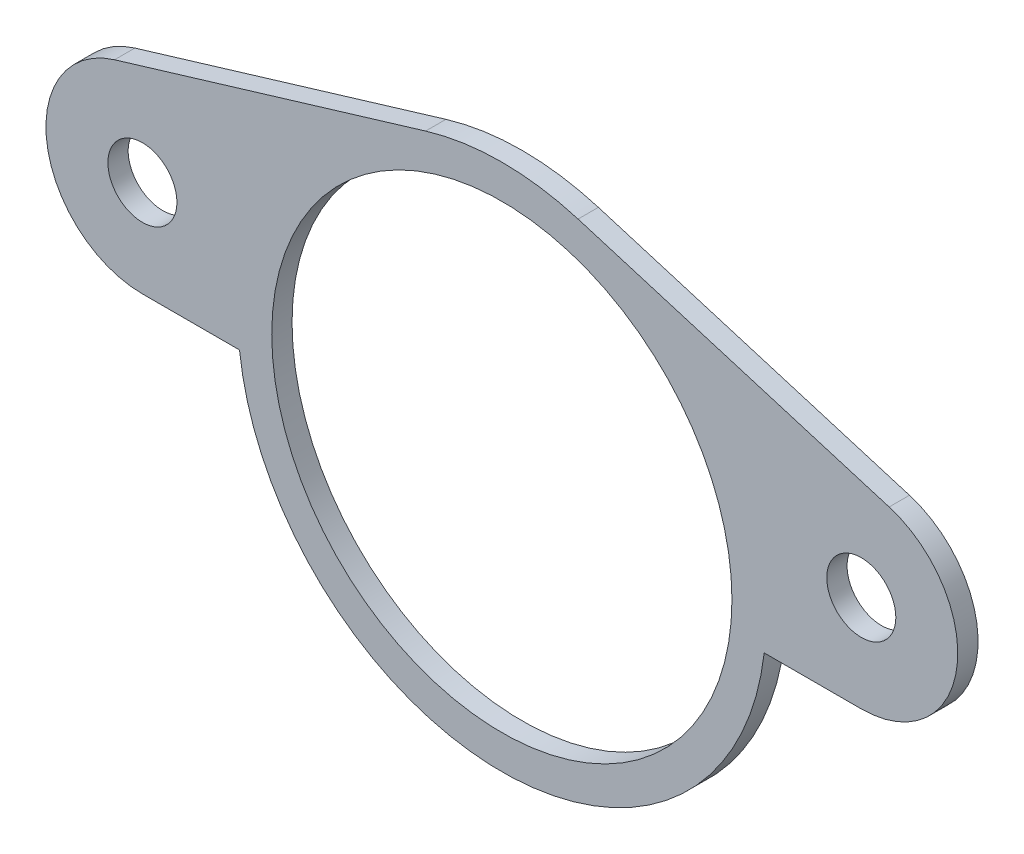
ISO-10303-21;
HEADER;
FILE_DESCRIPTION(('STEP AP214'),'2;1');
FILE_NAME('part.step','',(''),(''),'','','');
FILE_SCHEMA(('AUTOMOTIVE_DESIGN { 1 0 10303 214 1 1 1 1 }'));
ENDSEC;
DATA;
#1=APPLICATION_CONTEXT('core data for automotive mechanical design processes');
#2=APPLICATION_PROTOCOL_DEFINITION('international standard','automotive_design',2000,#1);
#3=PRODUCT_CONTEXT('',#1,'mechanical');
#4=PRODUCT('Part','Part','',(#3));
#5=PRODUCT_RELATED_PRODUCT_CATEGORY('part','',(#4));
#6=PRODUCT_DEFINITION_FORMATION('','',#4);
#7=PRODUCT_DEFINITION_CONTEXT('part definition',#1,'design');
#8=PRODUCT_DEFINITION('design','',#6,#7);
#9=PRODUCT_DEFINITION_SHAPE('','',#8);
#10=(LENGTH_UNIT() NAMED_UNIT(*) SI_UNIT(.MILLI.,.METRE.));
#11=(NAMED_UNIT(*) PLANE_ANGLE_UNIT() SI_UNIT($,.RADIAN.));
#12=(NAMED_UNIT(*) SI_UNIT($,.STERADIAN.) SOLID_ANGLE_UNIT());
#13=UNCERTAINTY_MEASURE_WITH_UNIT(LENGTH_MEASURE(1.E-05),#10,'distance_accuracy_value','');
#14=(GEOMETRIC_REPRESENTATION_CONTEXT(3) GLOBAL_UNCERTAINTY_ASSIGNED_CONTEXT((#13)) GLOBAL_UNIT_ASSIGNED_CONTEXT((#10,
#11,#12)) REPRESENTATION_CONTEXT('',''));
#15=CARTESIAN_POINT('',(0.,0.,0.));
#16=DIRECTION('',(0.,0.,1.));
#17=DIRECTION('',(1.,0.,0.));
#18=AXIS2_PLACEMENT_3D('',#15,#16,#17);
#19=CARTESIAN_POINT('',(-17.6986327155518,3.28,1.));
#20=DIRECTION('',(0.,0.,1.));
#21=DIRECTION('',(1.,0.,0.));
#22=AXIS2_PLACEMENT_3D('',#19,#20,#21);
#23=PLANE('',#22);
#24=CARTESIAN_POINT('',(17.6986327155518,3.28,1.));
#25=DIRECTION('',(0.,0.,1.));
#26=DIRECTION('',(1.,0.,0.));
#27=AXIS2_PLACEMENT_3D('',#24,#25,#26);
#28=CIRCLE('',#27,1.7);
#29=CARTESIAN_POINT('',(19.3986327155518,3.28,1.));
#30=VERTEX_POINT('',#29);
#31=EDGE_CURVE('E190',#30,#30,#28,.T.);
#32=ORIENTED_EDGE('',*,*,#31,.F.);
#33=EDGE_LOOP('',(#32));
#34=FACE_BOUND('',#33,.T.);
#35=CARTESIAN_POINT('',(-17.6986327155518,3.28,1.));
#36=DIRECTION('',(0.,0.,1.));
#37=DIRECTION('',(1.,0.,0.));
#38=AXIS2_PLACEMENT_3D('',#35,#36,#37);
#39=CIRCLE('',#38,4.75);
#40=CARTESIAN_POINT('',(-19.0699771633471,7.82773728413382,1.));
#41=VERTEX_POINT('',#40);
#42=CARTESIAN_POINT('',(-17.6986327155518,-1.47,1.));
#43=VERTEX_POINT('',#42);
#44=EDGE_CURVE('E153',#41,#43,#39,.T.);
#45=ORIENTED_EDGE('',*,*,#44,.T.);
#46=DIRECTION('',(1.,0.,0.));
#47=VECTOR('',#46,1.);
#48=CARTESIAN_POINT('',(-12.9166210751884,-1.47,1.));
#49=LINE('',#48,#47);
#50=CARTESIAN_POINT('',(-12.9166210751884,-1.47,1.));
#51=VERTEX_POINT('',#50);
#52=EDGE_CURVE('E101',#43,#51,#49,.T.);
#53=ORIENTED_EDGE('',*,*,#52,.T.);
#54=CARTESIAN_POINT('',(0.,0.,1.));
#55=DIRECTION('',(0.,0.,1.));
#56=DIRECTION('',(-1.,0.,0.));
#57=AXIS2_PLACEMENT_3D('',#54,#55,#56);
#58=CIRCLE('',#57,13.);
#59=CARTESIAN_POINT('',(12.9166210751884,-1.47,1.));
#60=VERTEX_POINT('',#59);
#61=EDGE_CURVE('E168',#51,#60,#58,.T.);
#62=ORIENTED_EDGE('',*,*,#61,.T.);
#63=DIRECTION('',(1.,0.,0.));
#64=VECTOR('',#63,1.);
#65=CARTESIAN_POINT('',(12.9166210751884,-1.47,1.));
#66=LINE('',#65,#64);
#67=CARTESIAN_POINT('',(17.6986327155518,-1.47,1.));
#68=VERTEX_POINT('',#67);
#69=EDGE_CURVE('E181',#60,#68,#66,.T.);
#70=ORIENTED_EDGE('',*,*,#69,.T.);
#71=CARTESIAN_POINT('',(17.6986327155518,3.28,1.));
#72=DIRECTION('',(0.,0.,1.));
#73=DIRECTION('',(-1.,0.,0.));
#74=AXIS2_PLACEMENT_3D('',#71,#72,#73);
#75=CIRCLE('',#74,4.75);
#76=CARTESIAN_POINT('',(19.0699771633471,7.82773728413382,1.));
#77=VERTEX_POINT('',#76);
#78=EDGE_CURVE('E120',#68,#77,#75,.T.);
#79=ORIENTED_EDGE('',*,*,#78,.T.);
#80=DIRECTION('',(-0.95741837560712,0.288704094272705,0.));
#81=VECTOR('',#80,1.);
#82=CARTESIAN_POINT('',(3.75315322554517,12.4464388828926,1.));
#83=LINE('',#82,#81);
#84=CARTESIAN_POINT('',(3.75315322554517,12.4464388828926,1.));
#85=VERTEX_POINT('',#84);
#86=EDGE_CURVE('E114',#77,#85,#83,.T.);
#87=ORIENTED_EDGE('',*,*,#86,.T.);
#88=CARTESIAN_POINT('',(0.,0.,1.));
#89=DIRECTION('',(0.,0.,1.));
#90=DIRECTION('',(-1.,0.,0.));
#91=AXIS2_PLACEMENT_3D('',#88,#89,#90);
#92=CIRCLE('',#91,13.);
#93=CARTESIAN_POINT('',(-3.75315322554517,12.4464388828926,1.));
#94=VERTEX_POINT('',#93);
#95=EDGE_CURVE('E118',#85,#94,#92,.T.);
#96=ORIENTED_EDGE('',*,*,#95,.T.);
#97=DIRECTION('',(-0.95741837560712,-0.288704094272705,0.));
#98=VECTOR('',#97,1.);
#99=CARTESIAN_POINT('',(-19.0699771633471,7.82773728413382,1.));
#100=LINE('',#99,#98);
#101=EDGE_CURVE('E58',#94,#41,#100,.T.);
#102=ORIENTED_EDGE('',*,*,#101,.T.);
#103=EDGE_LOOP('',(#45,#53,#62,#70,#79,#87,#96,#102));
#104=FACE_BOUND('',#103,.T.);
#105=CARTESIAN_POINT('',(-17.6986327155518,3.28,1.));
#106=DIRECTION('',(0.,0.,1.));
#107=DIRECTION('',(1.,0.,0.));
#108=AXIS2_PLACEMENT_3D('',#105,#106,#107);
#109=CIRCLE('',#108,1.7);
#110=CARTESIAN_POINT('',(-15.9986327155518,3.28,1.));
#111=VERTEX_POINT('',#110);
#112=EDGE_CURVE('E142',#111,#111,#109,.T.);
#113=ORIENTED_EDGE('',*,*,#112,.F.);
#114=EDGE_LOOP('',(#113));
#115=FACE_BOUND('',#114,.T.);
#116=CARTESIAN_POINT('',(0.,0.,1.));
#117=DIRECTION('',(0.,0.,1.));
#118=DIRECTION('',(1.,0.,0.));
#119=AXIS2_PLACEMENT_3D('',#116,#117,#118);
#120=CIRCLE('',#119,11.33);
#121=CARTESIAN_POINT('',(11.33,0.,1.));
#122=VERTEX_POINT('',#121);
#123=EDGE_CURVE('E196',#122,#122,#120,.T.);
#124=ORIENTED_EDGE('',*,*,#123,.F.);
#125=EDGE_LOOP('',(#124));
#126=FACE_BOUND('',#125,.T.);
#127=ADVANCED_FACE('F41',(#34,#104,#115,#126),#23,.T.);
#128=CARTESIAN_POINT('',(-17.6986327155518,3.28,0.));
#129=DIRECTION('',(0.,0.,1.));
#130=DIRECTION('',(1.,0.,0.));
#131=AXIS2_PLACEMENT_3D('',#128,#129,#130);
#132=PLANE('',#131);
#133=CARTESIAN_POINT('',(-17.6986327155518,3.28,0.));
#134=DIRECTION('',(0.,0.,1.));
#135=DIRECTION('',(1.,0.,0.));
#136=AXIS2_PLACEMENT_3D('',#133,#134,#135);
#137=CIRCLE('',#136,4.75);
#138=CARTESIAN_POINT('',(-19.0699771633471,7.82773728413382,0.));
#139=VERTEX_POINT('',#138);
#140=CARTESIAN_POINT('',(-17.6986327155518,-1.47,0.));
#141=VERTEX_POINT('',#140);
#142=EDGE_CURVE('E138',#139,#141,#137,.T.);
#143=ORIENTED_EDGE('',*,*,#142,.F.);
#144=DIRECTION('',(-0.95741837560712,-0.288704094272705,0.));
#145=VECTOR('',#144,1.);
#146=CARTESIAN_POINT('',(-19.0699771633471,7.82773728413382,0.));
#147=LINE('',#146,#145);
#148=CARTESIAN_POINT('',(-3.75315322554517,12.4464388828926,0.));
#149=VERTEX_POINT('',#148);
#150=EDGE_CURVE('E93',#149,#139,#147,.T.);
#151=ORIENTED_EDGE('',*,*,#150,.F.);
#152=CARTESIAN_POINT('',(0.,0.,0.));
#153=DIRECTION('',(0.,0.,1.));
#154=DIRECTION('',(-1.,0.,0.));
#155=AXIS2_PLACEMENT_3D('',#152,#153,#154);
#156=CIRCLE('',#155,13.);
#157=CARTESIAN_POINT('',(3.75315322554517,12.4464388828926,0.));
#158=VERTEX_POINT('',#157);
#159=EDGE_CURVE('E87',#158,#149,#156,.T.);
#160=ORIENTED_EDGE('',*,*,#159,.F.);
#161=DIRECTION('',(-0.95741837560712,0.288704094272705,0.));
#162=VECTOR('',#161,1.);
#163=CARTESIAN_POINT('',(3.75315322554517,12.4464388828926,0.));
#164=LINE('',#163,#162);
#165=CARTESIAN_POINT('',(19.0699771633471,7.82773728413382,0.));
#166=VERTEX_POINT('',#165);
#167=EDGE_CURVE('E128',#166,#158,#164,.T.);
#168=ORIENTED_EDGE('',*,*,#167,.F.);
#169=CARTESIAN_POINT('',(17.6986327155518,3.28,0.));
#170=DIRECTION('',(0.,0.,1.));
#171=DIRECTION('',(-1.,0.,0.));
#172=AXIS2_PLACEMENT_3D('',#169,#170,#171);
#173=CIRCLE('',#172,4.75);
#174=CARTESIAN_POINT('',(17.6986327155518,-1.47,0.));
#175=VERTEX_POINT('',#174);
#176=EDGE_CURVE('E148',#175,#166,#173,.T.);
#177=ORIENTED_EDGE('',*,*,#176,.F.);
#178=DIRECTION('',(1.,0.,0.));
#179=VECTOR('',#178,1.);
#180=CARTESIAN_POINT('',(12.9166210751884,-1.47,0.));
#181=LINE('',#180,#179);
#182=CARTESIAN_POINT('',(12.9166210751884,-1.47,0.));
#183=VERTEX_POINT('',#182);
#184=EDGE_CURVE('E146',#183,#175,#181,.T.);
#185=ORIENTED_EDGE('',*,*,#184,.F.);
#186=CARTESIAN_POINT('',(0.,0.,0.));
#187=DIRECTION('',(0.,0.,1.));
#188=DIRECTION('',(-1.,0.,0.));
#189=AXIS2_PLACEMENT_3D('',#186,#187,#188);
#190=CIRCLE('',#189,13.);
#191=CARTESIAN_POINT('',(-12.9166210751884,-1.47,0.));
#192=VERTEX_POINT('',#191);
#193=EDGE_CURVE('E144',#192,#183,#190,.T.);
#194=ORIENTED_EDGE('',*,*,#193,.F.);
#195=DIRECTION('',(1.,0.,0.));
#196=VECTOR('',#195,1.);
#197=CARTESIAN_POINT('',(-12.9166210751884,-1.47,0.));
#198=LINE('',#197,#196);
#199=EDGE_CURVE('E141',#141,#192,#198,.T.);
#200=ORIENTED_EDGE('',*,*,#199,.F.);
#201=EDGE_LOOP('',(#143,#151,#160,#168,#177,#185,#194,#200));
#202=FACE_BOUND('',#201,.T.);
#203=CARTESIAN_POINT('',(-17.6986327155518,3.28,0.));
#204=DIRECTION('',(0.,0.,1.));
#205=DIRECTION('',(1.,0.,0.));
#206=AXIS2_PLACEMENT_3D('',#203,#204,#205);
#207=CIRCLE('',#206,1.7);
#208=CARTESIAN_POINT('',(-15.9986327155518,3.28,0.));
#209=VERTEX_POINT('',#208);
#210=EDGE_CURVE('E187',#209,#209,#207,.T.);
#211=ORIENTED_EDGE('',*,*,#210,.T.);
#212=EDGE_LOOP('',(#211));
#213=FACE_BOUND('',#212,.T.);
#214=CARTESIAN_POINT('',(17.6986327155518,3.28,0.));
#215=DIRECTION('',(0.,0.,1.));
#216=DIRECTION('',(1.,0.,0.));
#217=AXIS2_PLACEMENT_3D('',#214,#215,#216);
#218=CIRCLE('',#217,1.7);
#219=CARTESIAN_POINT('',(19.3986327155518,3.28,0.));
#220=VERTEX_POINT('',#219);
#221=EDGE_CURVE('E193',#220,#220,#218,.T.);
#222=ORIENTED_EDGE('',*,*,#221,.T.);
#223=EDGE_LOOP('',(#222));
#224=FACE_BOUND('',#223,.T.);
#225=CARTESIAN_POINT('',(0.,0.,0.));
#226=DIRECTION('',(0.,0.,1.));
#227=DIRECTION('',(1.,0.,0.));
#228=AXIS2_PLACEMENT_3D('',#225,#226,#227);
#229=CIRCLE('',#228,11.33);
#230=CARTESIAN_POINT('',(11.33,0.,0.));
#231=VERTEX_POINT('',#230);
#232=EDGE_CURVE('E199',#231,#231,#229,.T.);
#233=ORIENTED_EDGE('',*,*,#232,.T.);
#234=EDGE_LOOP('',(#233));
#235=FACE_BOUND('',#234,.T.);
#236=ADVANCED_FACE('F172',(#202,#213,#224,#235),#132,.F.);
#237=CARTESIAN_POINT('',(-17.6986327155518,3.28,1.));
#238=DIRECTION('',(0.,0.,-1.));
#239=DIRECTION('',(-1.,0.,0.));
#240=AXIS2_PLACEMENT_3D('',#237,#238,#239);
#241=CYLINDRICAL_SURFACE('',#240,4.75);
#242=ORIENTED_EDGE('',*,*,#142,.T.);
#243=DIRECTION('',(0.,0.,-1.));
#244=VECTOR('',#243,1.);
#245=CARTESIAN_POINT('',(-17.6986327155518,-1.47,1.));
#246=LINE('',#245,#244);
#247=EDGE_CURVE('E11',#43,#141,#246,.T.);
#248=ORIENTED_EDGE('',*,*,#247,.F.);
#249=ORIENTED_EDGE('',*,*,#44,.F.);
#250=DIRECTION('',(0.,0.,-1.));
#251=VECTOR('',#250,1.);
#252=CARTESIAN_POINT('',(-19.0699771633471,7.82773728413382,1.));
#253=LINE('',#252,#251);
#254=EDGE_CURVE('E134',#41,#139,#253,.T.);
#255=ORIENTED_EDGE('',*,*,#254,.T.);
#256=EDGE_LOOP('',(#242,#248,#249,#255));
#257=FACE_BOUND('',#256,.T.);
#258=ADVANCED_FACE('F43',(#257),#241,.T.);
#259=CARTESIAN_POINT('',(-12.9166210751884,-1.47,1.));
#260=DIRECTION('',(0.,1.,0.));
#261=DIRECTION('',(-1.,0.,0.));
#262=AXIS2_PLACEMENT_3D('',#259,#260,#261);
#263=PLANE('',#262);
#264=ORIENTED_EDGE('',*,*,#199,.T.);
#265=DIRECTION('',(0.,0.,-1.));
#266=VECTOR('',#265,1.);
#267=CARTESIAN_POINT('',(-12.9166210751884,-1.47,1.));
#268=LINE('',#267,#266);
#269=EDGE_CURVE('E50',#51,#192,#268,.T.);
#270=ORIENTED_EDGE('',*,*,#269,.F.);
#271=ORIENTED_EDGE('',*,*,#52,.F.);
#272=ORIENTED_EDGE('',*,*,#247,.T.);
#273=EDGE_LOOP('',(#264,#270,#271,#272));
#274=FACE_BOUND('',#273,.T.);
#275=ADVANCED_FACE('F232',(#274),#263,.F.);
#276=CARTESIAN_POINT('',(0.,0.,1.));
#277=DIRECTION('',(0.,0.,-1.));
#278=DIRECTION('',(-1.,0.,0.));
#279=AXIS2_PLACEMENT_3D('',#276,#277,#278);
#280=CYLINDRICAL_SURFACE('',#279,13.);
#281=ORIENTED_EDGE('',*,*,#193,.T.);
#282=DIRECTION('',(0.,0.,-1.));
#283=VECTOR('',#282,1.);
#284=CARTESIAN_POINT('',(12.9166210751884,-1.47,1.));
#285=LINE('',#284,#283);
#286=EDGE_CURVE('E160',#60,#183,#285,.T.);
#287=ORIENTED_EDGE('',*,*,#286,.F.);
#288=ORIENTED_EDGE('',*,*,#61,.F.);
#289=ORIENTED_EDGE('',*,*,#269,.T.);
#290=EDGE_LOOP('',(#281,#287,#288,#289));
#291=FACE_BOUND('',#290,.T.);
#292=ADVANCED_FACE('F166',(#291),#280,.T.);
#293=CARTESIAN_POINT('',(12.9166210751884,-1.47,1.));
#294=DIRECTION('',(0.,1.,0.));
#295=DIRECTION('',(-1.,0.,0.));
#296=AXIS2_PLACEMENT_3D('',#293,#294,#295);
#297=PLANE('',#296);
#298=ORIENTED_EDGE('',*,*,#184,.T.);
#299=DIRECTION('',(0.,0.,-1.));
#300=VECTOR('',#299,1.);
#301=CARTESIAN_POINT('',(17.6986327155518,-1.47,1.));
#302=LINE('',#301,#300);
#303=EDGE_CURVE('E157',#68,#175,#302,.T.);
#304=ORIENTED_EDGE('',*,*,#303,.F.);
#305=ORIENTED_EDGE('',*,*,#69,.F.);
#306=ORIENTED_EDGE('',*,*,#286,.T.);
#307=EDGE_LOOP('',(#298,#304,#305,#306));
#308=FACE_BOUND('',#307,.T.);
#309=ADVANCED_FACE('F177',(#308),#297,.F.);
#310=CARTESIAN_POINT('',(17.6986327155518,3.28,1.));
#311=DIRECTION('',(0.,0.,-1.));
#312=DIRECTION('',(-1.,0.,0.));
#313=AXIS2_PLACEMENT_3D('',#310,#311,#312);
#314=CYLINDRICAL_SURFACE('',#313,4.75);
#315=ORIENTED_EDGE('',*,*,#176,.T.);
#316=DIRECTION('',(0.,0.,-1.));
#317=VECTOR('',#316,1.);
#318=CARTESIAN_POINT('',(19.0699771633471,7.82773728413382,1.));
#319=LINE('',#318,#317);
#320=EDGE_CURVE('E129',#77,#166,#319,.T.);
#321=ORIENTED_EDGE('',*,*,#320,.F.);
#322=ORIENTED_EDGE('',*,*,#78,.F.);
#323=ORIENTED_EDGE('',*,*,#303,.T.);
#324=EDGE_LOOP('',(#315,#321,#322,#323));
#325=FACE_BOUND('',#324,.T.);
#326=ADVANCED_FACE('F180',(#325),#314,.T.);
#327=CARTESIAN_POINT('',(3.75315322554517,12.4464388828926,1.));
#328=DIRECTION('',(-0.288704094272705,-0.95741837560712,0.));
#329=DIRECTION('',(0.95741837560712,-0.288704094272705,0.));
#330=AXIS2_PLACEMENT_3D('',#327,#328,#329);
#331=PLANE('',#330);
#332=ORIENTED_EDGE('',*,*,#167,.T.);
#333=DIRECTION('',(0.,0.,-1.));
#334=VECTOR('',#333,1.);
#335=CARTESIAN_POINT('',(3.75315322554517,12.4464388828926,1.));
#336=LINE('',#335,#334);
#337=EDGE_CURVE('E125',#85,#158,#336,.T.);
#338=ORIENTED_EDGE('',*,*,#337,.F.);
#339=ORIENTED_EDGE('',*,*,#86,.F.);
#340=ORIENTED_EDGE('',*,*,#320,.T.);
#341=EDGE_LOOP('',(#332,#338,#339,#340));
#342=FACE_BOUND('',#341,.T.);
#343=ADVANCED_FACE('F126',(#342),#331,.F.);
#344=CARTESIAN_POINT('',(0.,0.,1.));
#345=DIRECTION('',(0.,0.,-1.));
#346=DIRECTION('',(-1.,0.,0.));
#347=AXIS2_PLACEMENT_3D('',#344,#345,#346);
#348=CYLINDRICAL_SURFACE('',#347,13.);
#349=ORIENTED_EDGE('',*,*,#159,.T.);
#350=DIRECTION('',(0.,0.,-1.));
#351=VECTOR('',#350,1.);
#352=CARTESIAN_POINT('',(-3.75315322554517,12.4464388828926,1.));
#353=LINE('',#352,#351);
#354=EDGE_CURVE('E130',#94,#149,#353,.T.);
#355=ORIENTED_EDGE('',*,*,#354,.F.);
#356=ORIENTED_EDGE('',*,*,#95,.F.);
#357=ORIENTED_EDGE('',*,*,#337,.T.);
#358=EDGE_LOOP('',(#349,#355,#356,#357));
#359=FACE_BOUND('',#358,.T.);
#360=ADVANCED_FACE('F132',(#359),#348,.T.);
#361=CARTESIAN_POINT('',(-19.0699771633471,7.82773728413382,1.));
#362=DIRECTION('',(0.288704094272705,-0.95741837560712,0.));
#363=DIRECTION('',(0.95741837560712,0.288704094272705,0.));
#364=AXIS2_PLACEMENT_3D('',#361,#362,#363);
#365=PLANE('',#364);
#366=ORIENTED_EDGE('',*,*,#150,.T.);
#367=ORIENTED_EDGE('',*,*,#254,.F.);
#368=ORIENTED_EDGE('',*,*,#101,.F.);
#369=ORIENTED_EDGE('',*,*,#354,.T.);
#370=EDGE_LOOP('',(#366,#367,#368,#369));
#371=FACE_BOUND('',#370,.T.);
#372=ADVANCED_FACE('F220',(#371),#365,.F.);
#373=CARTESIAN_POINT('',(-17.6986327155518,3.28,1.));
#374=DIRECTION('',(0.,0.,-1.));
#375=DIRECTION('',(-1.,0.,0.));
#376=AXIS2_PLACEMENT_3D('',#373,#374,#375);
#377=CYLINDRICAL_SURFACE('',#376,1.7);
#378=ORIENTED_EDGE('',*,*,#112,.T.);
#379=EDGE_LOOP('',(#378));
#380=FACE_BOUND('',#379,.T.);
#381=ORIENTED_EDGE('',*,*,#210,.F.);
#382=EDGE_LOOP('',(#381));
#383=FACE_BOUND('',#382,.T.);
#384=ADVANCED_FACE('F217',(#380,#383),#377,.F.);
#385=CARTESIAN_POINT('',(17.6986327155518,3.28,1.));
#386=DIRECTION('',(0.,0.,-1.));
#387=DIRECTION('',(-1.,0.,0.));
#388=AXIS2_PLACEMENT_3D('',#385,#386,#387);
#389=CYLINDRICAL_SURFACE('',#388,1.7);
#390=ORIENTED_EDGE('',*,*,#31,.T.);
#391=EDGE_LOOP('',(#390));
#392=FACE_BOUND('',#391,.T.);
#393=ORIENTED_EDGE('',*,*,#221,.F.);
#394=EDGE_LOOP('',(#393));
#395=FACE_BOUND('',#394,.T.);
#396=ADVANCED_FACE('F295',(#392,#395),#389,.F.);
#397=CARTESIAN_POINT('',(0.,0.,1.));
#398=DIRECTION('',(0.,0.,-1.));
#399=DIRECTION('',(-1.,0.,0.));
#400=AXIS2_PLACEMENT_3D('',#397,#398,#399);
#401=CYLINDRICAL_SURFACE('',#400,11.33);
#402=ORIENTED_EDGE('',*,*,#123,.T.);
#403=EDGE_LOOP('',(#402));
#404=FACE_BOUND('',#403,.T.);
#405=ORIENTED_EDGE('',*,*,#232,.F.);
#406=EDGE_LOOP('',(#405));
#407=FACE_BOUND('',#406,.T.);
#408=ADVANCED_FACE('F205',(#404,#407),#401,.F.);
#409=CLOSED_SHELL('',(#127,#236,#258,#275,#292,#309,#326,#343,#360,#372,#384,#396,#408));
#410=MANIFOLD_SOLID_BREP('B2',#409);
#411=ADVANCED_BREP_SHAPE_REPRESENTATION('',(#18,#410),#14);
#412=SHAPE_DEFINITION_REPRESENTATION(#9,#411);
ENDSEC;
END-ISO-10303-21;
